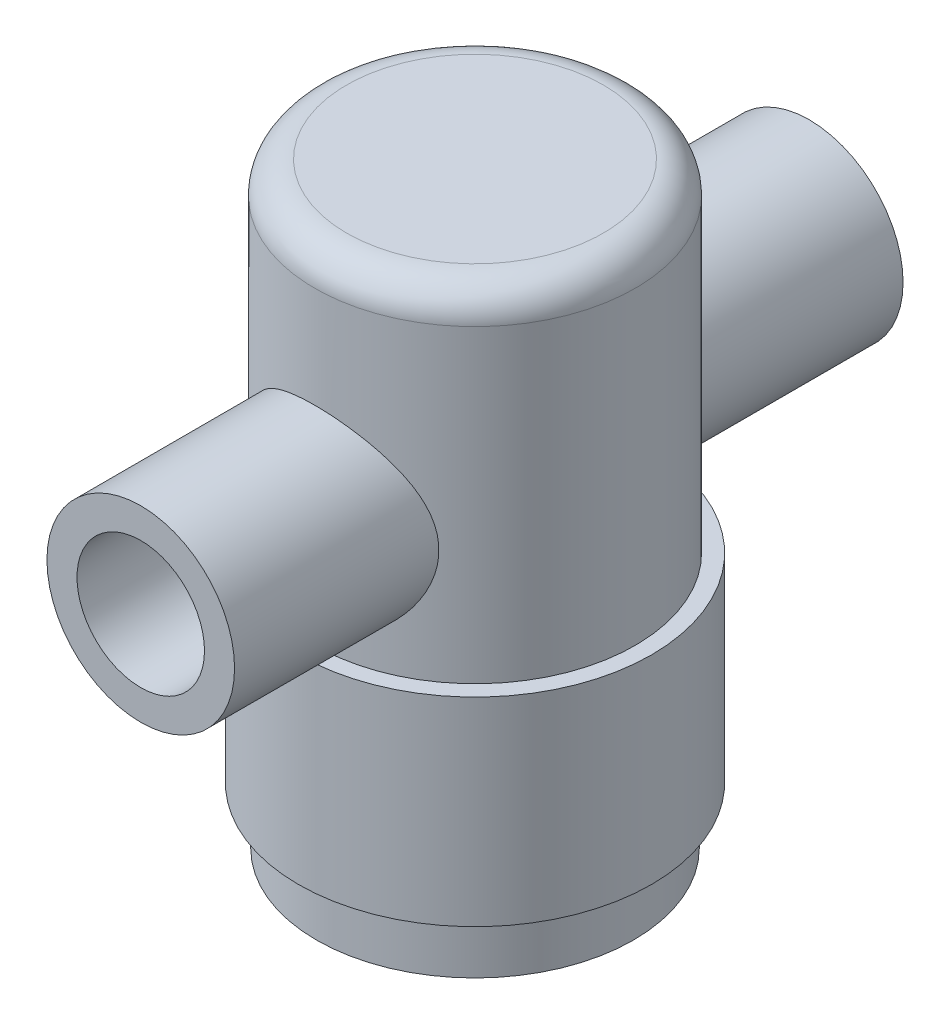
ISO-10303-21;
HEADER;
FILE_DESCRIPTION(('STEP AP214'),'2;1');
FILE_NAME('part.step','',(''),(''),'','','');
FILE_SCHEMA(('AUTOMOTIVE_DESIGN { 1 0 10303 214 1 1 1 1 }'));
ENDSEC;
DATA;
#1=APPLICATION_CONTEXT('core data for automotive mechanical design processes');
#2=APPLICATION_PROTOCOL_DEFINITION('international standard','automotive_design',2000,#1);
#3=PRODUCT_CONTEXT('',#1,'mechanical');
#4=PRODUCT('Part','Part','',(#3));
#5=PRODUCT_RELATED_PRODUCT_CATEGORY('part','',(#4));
#6=PRODUCT_DEFINITION_FORMATION('','',#4);
#7=PRODUCT_DEFINITION_CONTEXT('part definition',#1,'design');
#8=PRODUCT_DEFINITION('design','',#6,#7);
#9=PRODUCT_DEFINITION_SHAPE('','',#8);
#10=(LENGTH_UNIT() NAMED_UNIT(*) SI_UNIT(.MILLI.,.METRE.));
#11=(NAMED_UNIT(*) PLANE_ANGLE_UNIT() SI_UNIT($,.RADIAN.));
#12=(NAMED_UNIT(*) SI_UNIT($,.STERADIAN.) SOLID_ANGLE_UNIT());
#13=UNCERTAINTY_MEASURE_WITH_UNIT(LENGTH_MEASURE(1.E-05),#10,'distance_accuracy_value','');
#14=(GEOMETRIC_REPRESENTATION_CONTEXT(3) GLOBAL_UNCERTAINTY_ASSIGNED_CONTEXT((#13)) GLOBAL_UNIT_ASSIGNED_CONTEXT((#10,
#11,#12)) REPRESENTATION_CONTEXT('',''));
#15=CARTESIAN_POINT('',(0.,0.,0.));
#16=DIRECTION('',(0.,0.,1.));
#17=DIRECTION('',(1.,0.,0.));
#18=AXIS2_PLACEMENT_3D('',#15,#16,#17);
#19=CARTESIAN_POINT('',(0.,18.4404,-16.6497));
#20=DIRECTION('',(0.,0.,1.));
#21=DIRECTION('',(1.,0.,0.));
#22=AXIS2_PLACEMENT_3D('',#19,#20,#21);
#23=CYLINDRICAL_SURFACE('',#22,0.79375);
#24=CARTESIAN_POINT('',(0.79375,18.4404,-3.07418053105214));
#25=CARTESIAN_POINT('',(0.793748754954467,18.4842311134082,-3.07418136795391));
#26=CARTESIAN_POINT('',(0.790107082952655,18.5280760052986,-3.07512817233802));
#27=CARTESIAN_POINT('',(0.775659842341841,18.6145067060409,-3.07880341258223));
#28=CARTESIAN_POINT('',(0.764850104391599,18.6570917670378,-3.08153288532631));
#29=CARTESIAN_POINT('',(0.736438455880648,18.7397401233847,-3.08844545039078));
#30=CARTESIAN_POINT('',(0.718845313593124,18.7798065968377,-3.09262666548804));
#31=CARTESIAN_POINT('',(0.677392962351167,18.8564236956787,-3.10196925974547));
#32=CARTESIAN_POINT('',(0.653533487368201,18.8929741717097,-3.10713068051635));
#33=CARTESIAN_POINT('',(0.599664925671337,18.9623260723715,-3.11797927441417));
#34=CARTESIAN_POINT('',(0.569543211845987,18.9950387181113,-3.12367484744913));
#35=CARTESIAN_POINT('',(0.504247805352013,19.0550042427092,-3.13487712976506));
#36=CARTESIAN_POINT('',(0.469073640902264,19.0822566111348,-3.14038382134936));
#37=CARTESIAN_POINT('',(0.394063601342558,19.130891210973,-3.15068081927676));
#38=CARTESIAN_POINT('',(0.35416952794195,19.1521862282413,-3.15546005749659));
#39=CARTESIAN_POINT('',(0.271228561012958,19.1877345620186,-3.16366782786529));
#40=CARTESIAN_POINT('',(0.228182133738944,19.2019889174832,-3.16709655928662));
#41=CARTESIAN_POINT('',(0.141083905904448,19.2227669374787,-3.1721576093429));
#42=CARTESIAN_POINT('',(0.097070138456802,19.2294413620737,-3.17382491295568));
#43=CARTESIAN_POINT('',(0.00851815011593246,19.23534328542,-3.17529716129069));
#44=CARTESIAN_POINT('',(-0.0360199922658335,19.2345718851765,-3.17510238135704));
#45=CARTESIAN_POINT('',(-0.123310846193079,19.2257124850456,-3.17289845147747));
#46=CARTESIAN_POINT('',(-0.166081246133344,19.2177872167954,-3.17092965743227));
#47=CARTESIAN_POINT('',(-0.249664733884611,19.1951066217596,-3.16544590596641));
#48=CARTESIAN_POINT('',(-0.290477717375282,19.1803509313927,-3.16193086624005));
#49=CARTESIAN_POINT('',(-0.369416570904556,19.1442966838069,-3.15368784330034));
#50=CARTESIAN_POINT('',(-0.407514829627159,19.1229402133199,-3.1489491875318));
#51=CARTESIAN_POINT('',(-0.47964377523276,19.0743345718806,-3.13877294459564));
#52=CARTESIAN_POINT('',(-0.513673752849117,19.047084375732,-3.13333523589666));
#53=CARTESIAN_POINT('',(-0.577670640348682,18.9865924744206,-3.12217979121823));
#54=CARTESIAN_POINT('',(-0.607502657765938,18.9532085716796,-3.11645845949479));
#55=CARTESIAN_POINT('',(-0.661174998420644,18.881852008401,-3.10551526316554));
#56=CARTESIAN_POINT('',(-0.685015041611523,18.8438791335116,-3.10029342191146));
#57=CARTESIAN_POINT('',(-0.726113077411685,18.7641579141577,-3.09092757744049));
#58=CARTESIAN_POINT('',(-0.743338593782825,18.7223921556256,-3.08678892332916));
#59=CARTESIAN_POINT('',(-0.770481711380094,18.6364291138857,-3.08012668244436));
#60=CARTESIAN_POINT('',(-0.780400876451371,18.5922323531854,-3.07760275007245));
#61=CARTESIAN_POINT('',(-0.792425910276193,18.5039128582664,-3.07452825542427));
#62=CARTESIAN_POINT('',(-0.794731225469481,18.4598190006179,-3.07392733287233));
#63=CARTESIAN_POINT('',(-0.792009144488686,18.3718765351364,-3.0746298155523));
#64=CARTESIAN_POINT('',(-0.786982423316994,18.3280279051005,-3.07593304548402));
#65=CARTESIAN_POINT('',(-0.769913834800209,18.2425612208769,-3.08024873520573));
#66=CARTESIAN_POINT('',(-0.757988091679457,18.2009184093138,-3.08323288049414));
#67=CARTESIAN_POINT('',(-0.727588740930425,18.1202230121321,-3.09054728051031));
#68=CARTESIAN_POINT('',(-0.709114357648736,18.0811707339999,-3.09487769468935));
#69=CARTESIAN_POINT('',(-0.66572468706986,18.0059198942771,-3.10450273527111));
#70=CARTESIAN_POINT('',(-0.640690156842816,17.9697923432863,-3.10981461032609));
#71=CARTESIAN_POINT('',(-0.585041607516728,17.9021776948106,-3.1207617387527));
#72=CARTESIAN_POINT('',(-0.554426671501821,17.8706913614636,-3.12639704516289));
#73=CARTESIAN_POINT('',(-0.487571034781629,17.8124449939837,-3.13752675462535));
#74=CARTESIAN_POINT('',(-0.451208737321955,17.7858229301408,-3.14301410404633));
#75=CARTESIAN_POINT('',(-0.374414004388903,17.739062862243,-3.15308366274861));
#76=CARTESIAN_POINT('',(-0.333981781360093,17.7189245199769,-3.15766591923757));
#77=CARTESIAN_POINT('',(-0.250474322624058,17.6858783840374,-3.16538011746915));
#78=CARTESIAN_POINT('',(-0.207420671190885,17.6729185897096,-3.16852246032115));
#79=CARTESIAN_POINT('',(-0.119657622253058,17.6544413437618,-3.17304830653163));
#80=CARTESIAN_POINT('',(-0.0749485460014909,17.6489224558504,-3.17443214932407));
#81=CARTESIAN_POINT('',(0.0135600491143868,17.6455644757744,-3.17527121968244));
#82=CARTESIAN_POINT('',(0.0573514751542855,17.6475217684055,-3.17477758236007));
#83=CARTESIAN_POINT('',(0.143960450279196,17.6585942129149,-3.1720305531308));
#84=CARTESIAN_POINT('',(0.186778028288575,17.6677091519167,-3.16977721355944));
#85=CARTESIAN_POINT('',(0.27001075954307,17.6927289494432,-3.16377187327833));
#86=CARTESIAN_POINT('',(0.310437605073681,17.7085969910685,-3.16002800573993));
#87=CARTESIAN_POINT('',(0.388077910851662,17.7466391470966,-3.15143585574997));
#88=CARTESIAN_POINT('',(0.425290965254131,17.7688140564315,-3.14658743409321));
#89=CARTESIAN_POINT('',(0.496412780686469,17.8194614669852,-3.13616379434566));
#90=CARTESIAN_POINT('',(0.53022102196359,17.8480721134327,-3.13057394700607));
#91=CARTESIAN_POINT('',(0.592625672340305,17.9105106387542,-3.11936327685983));
#92=CARTESIAN_POINT('',(0.621220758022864,17.9443398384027,-3.11374244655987));
#93=CARTESIAN_POINT('',(0.672911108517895,18.0170148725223,-3.10298683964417));
#94=CARTESIAN_POINT('',(0.695893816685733,18.0559425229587,-3.09786308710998));
#95=CARTESIAN_POINT('',(0.73495447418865,18.1372315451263,-3.088830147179));
#96=CARTESIAN_POINT('',(0.751037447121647,18.1795903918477,-3.08492007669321));
#97=CARTESIAN_POINT('',(0.773447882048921,18.2582955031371,-3.07936827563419));
#98=CARTESIAN_POINT('',(0.781044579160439,18.2942651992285,-3.07743751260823));
#99=CARTESIAN_POINT('',(0.791195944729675,18.3669534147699,-3.07484334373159));
#100=CARTESIAN_POINT('',(0.793751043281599,18.4036718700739,-3.0741798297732));
#101=CARTESIAN_POINT('',(0.79375,18.4404,-3.07418053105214));
#102=B_SPLINE_CURVE_WITH_KNOTS('',3,(#24,#25,#26,#27,#28,#29,#30,#31,#32,#33,#34,#35,#36,#37,
#38,#39,#40,#41,#42,#43,#44,#45,#46,#47,#48,#49,#50,#51,#52,#53,#54,#55,#56,#57,#58,#59,#60,#61,
#62,#63,#64,#65,#66,#67,#68,#69,#70,#71,#72,#73,#74,#75,#76,#77,#78,#79,#80,#81,#82,#83,#84,#85,
#86,#87,#88,#89,#90,#91,#92,#93,#94,#95,#96,#97,#98,#99,#100,#101),.UNSPECIFIED.,.T.,.F.,(4,2,2,
2,2,2,2,2,2,2,2,2,2,2,2,2,2,2,2,2,2,2,2,2,2,2,2,2,2,2,2,2,2,2,2,2,2,2,4),(0.,0.131358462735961,
0.262793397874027,0.394059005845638,0.525330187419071,0.659206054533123,0.793094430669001,
0.928851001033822,1.06458753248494,1.19757428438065,1.33054137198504,1.46055798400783,
1.59058151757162,1.72177987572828,1.85300107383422,1.98777373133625,2.12255268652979,
2.2579851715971,2.39338866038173,2.52521584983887,2.65703090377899,2.78668926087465,
2.91636298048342,3.04858053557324,3.18081983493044,3.31636792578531,3.45190894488,
3.58645483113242,3.72097474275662,3.8518574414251,3.98273624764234,4.11291048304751,
4.2431011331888,4.3764107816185,4.50975422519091,4.64558531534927,4.78131734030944,
4.89139810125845,5.0014694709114),.UNSPECIFIED.);
#103=CARTESIAN_POINT('',(0.79375,18.4404,-3.07418053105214));
#104=VERTEX_POINT('',#103);
#105=EDGE_CURVE('E115',#104,#104,#102,.T.);
#106=ORIENTED_EDGE('',*,*,#105,.T.);
#107=EDGE_LOOP('',(#106));
#108=FACE_BOUND('',#107,.T.);
#109=CARTESIAN_POINT('',(0.,18.4404,-8.5217));
#110=DIRECTION('',(0.,0.,-1.));
#111=DIRECTION('',(-1.,0.,0.));
#112=AXIS2_PLACEMENT_3D('',#109,#110,#111);
#113=CIRCLE('',#112,0.79375);
#114=CARTESIAN_POINT('',(-0.79375,18.4404,-8.5217));
#115=VERTEX_POINT('',#114);
#116=EDGE_CURVE('E36',#115,#115,#113,.F.);
#117=ORIENTED_EDGE('',*,*,#116,.F.);
#118=EDGE_LOOP('',(#117));
#119=FACE_BOUND('',#118,.T.);
#120=ADVANCED_FACE('F32',(#108,#119),#23,.F.);
#121=CARTESIAN_POINT('',(0.79375,18.4404,3.07418053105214));
#122=CARTESIAN_POINT('',(0.793748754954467,18.3965688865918,3.07418136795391));
#123=CARTESIAN_POINT('',(0.790107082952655,18.3527239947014,3.07512817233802));
#124=CARTESIAN_POINT('',(0.775659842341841,18.2662932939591,3.07880341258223));
#125=CARTESIAN_POINT('',(0.764850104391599,18.2237082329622,3.08153288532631));
#126=CARTESIAN_POINT('',(0.736438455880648,18.1410598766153,3.08844545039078));
#127=CARTESIAN_POINT('',(0.718845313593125,18.1009934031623,3.09262666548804));
#128=CARTESIAN_POINT('',(0.677392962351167,18.0243763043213,3.10196925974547));
#129=CARTESIAN_POINT('',(0.653533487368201,17.9878258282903,3.10713068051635));
#130=CARTESIAN_POINT('',(0.599664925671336,17.9184739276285,3.11797927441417));
#131=CARTESIAN_POINT('',(0.569543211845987,17.8857612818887,3.12367484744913));
#132=CARTESIAN_POINT('',(0.504247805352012,17.8257957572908,3.13487712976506));
#133=CARTESIAN_POINT('',(0.469073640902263,17.7985433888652,3.14038382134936));
#134=CARTESIAN_POINT('',(0.394063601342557,17.749908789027,3.15068081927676));
#135=CARTESIAN_POINT('',(0.35416952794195,17.7286137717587,3.15546005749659));
#136=CARTESIAN_POINT('',(0.271228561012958,17.6930654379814,3.16366782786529));
#137=CARTESIAN_POINT('',(0.228182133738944,17.6788110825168,3.16709655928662));
#138=CARTESIAN_POINT('',(0.141083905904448,17.6580330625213,3.1721576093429));
#139=CARTESIAN_POINT('',(0.0970701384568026,17.6513586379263,3.17382491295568));
#140=CARTESIAN_POINT('',(0.00851815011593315,17.64545671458,3.17529716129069));
#141=CARTESIAN_POINT('',(-0.036019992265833,17.6462281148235,3.17510238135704));
#142=CARTESIAN_POINT('',(-0.123310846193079,17.6550875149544,3.17289845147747));
#143=CARTESIAN_POINT('',(-0.166081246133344,17.6630127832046,3.17092965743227));
#144=CARTESIAN_POINT('',(-0.249664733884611,17.6856933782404,3.16544590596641));
#145=CARTESIAN_POINT('',(-0.290477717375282,17.7004490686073,3.16193086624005));
#146=CARTESIAN_POINT('',(-0.369416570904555,17.7365033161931,3.15368784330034));
#147=CARTESIAN_POINT('',(-0.407514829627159,17.7578597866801,3.1489491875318));
#148=CARTESIAN_POINT('',(-0.47964377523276,17.8064654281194,3.13877294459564));
#149=CARTESIAN_POINT('',(-0.513673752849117,17.833715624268,3.13333523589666));
#150=CARTESIAN_POINT('',(-0.577670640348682,17.8942075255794,3.12217979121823));
#151=CARTESIAN_POINT('',(-0.607502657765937,17.9275914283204,3.11645845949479));
#152=CARTESIAN_POINT('',(-0.661174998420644,17.998947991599,3.10551526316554));
#153=CARTESIAN_POINT('',(-0.685015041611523,18.0369208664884,3.10029342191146));
#154=CARTESIAN_POINT('',(-0.726113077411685,18.1166420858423,3.09092757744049));
#155=CARTESIAN_POINT('',(-0.743338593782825,18.1584078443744,3.08678892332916));
#156=CARTESIAN_POINT('',(-0.770481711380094,18.2443708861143,3.08012668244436));
#157=CARTESIAN_POINT('',(-0.780400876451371,18.2885676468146,3.07760275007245));
#158=CARTESIAN_POINT('',(-0.792425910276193,18.3768871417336,3.07452825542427));
#159=CARTESIAN_POINT('',(-0.794731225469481,18.4209809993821,3.07392733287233));
#160=CARTESIAN_POINT('',(-0.792009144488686,18.5089234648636,3.0746298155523));
#161=CARTESIAN_POINT('',(-0.786982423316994,18.5527720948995,3.07593304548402));
#162=CARTESIAN_POINT('',(-0.769913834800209,18.6382387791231,3.08024873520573));
#163=CARTESIAN_POINT('',(-0.757988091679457,18.6798815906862,3.08323288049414));
#164=CARTESIAN_POINT('',(-0.727588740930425,18.7605769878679,3.09054728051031));
#165=CARTESIAN_POINT('',(-0.709114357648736,18.7996292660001,3.09487769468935));
#166=CARTESIAN_POINT('',(-0.66572468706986,18.8748801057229,3.10450273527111));
#167=CARTESIAN_POINT('',(-0.640690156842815,18.9110076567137,3.10981461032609));
#168=CARTESIAN_POINT('',(-0.585041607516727,18.9786223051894,3.1207617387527));
#169=CARTESIAN_POINT('',(-0.55442667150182,19.0101086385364,3.12639704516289));
#170=CARTESIAN_POINT('',(-0.487571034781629,19.0683550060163,3.13752675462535));
#171=CARTESIAN_POINT('',(-0.451208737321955,19.0949770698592,3.14301410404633));
#172=CARTESIAN_POINT('',(-0.374414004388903,19.141737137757,3.15308366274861));
#173=CARTESIAN_POINT('',(-0.333981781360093,19.1618754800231,3.15766591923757));
#174=CARTESIAN_POINT('',(-0.250474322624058,19.1949216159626,3.16538011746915));
#175=CARTESIAN_POINT('',(-0.207420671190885,19.2078814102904,3.16852246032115));
#176=CARTESIAN_POINT('',(-0.119657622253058,19.2263586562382,3.17304830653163));
#177=CARTESIAN_POINT('',(-0.0749485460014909,19.2318775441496,3.17443214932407));
#178=CARTESIAN_POINT('',(0.0135600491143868,19.2352355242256,3.17527121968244));
#179=CARTESIAN_POINT('',(0.0573514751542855,19.2332782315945,3.17477758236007));
#180=CARTESIAN_POINT('',(0.143960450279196,19.2222057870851,3.1720305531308));
#181=CARTESIAN_POINT('',(0.186778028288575,19.2130908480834,3.16977721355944));
#182=CARTESIAN_POINT('',(0.27001075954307,19.1880710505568,3.16377187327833));
#183=CARTESIAN_POINT('',(0.310437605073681,19.1722030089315,3.16002800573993));
#184=CARTESIAN_POINT('',(0.388077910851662,19.1341608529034,3.15143585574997));
#185=CARTESIAN_POINT('',(0.425290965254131,19.1119859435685,3.14658743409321));
#186=CARTESIAN_POINT('',(0.496412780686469,19.0613385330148,3.13616379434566));
#187=CARTESIAN_POINT('',(0.53022102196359,19.0327278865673,3.13057394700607));
#188=CARTESIAN_POINT('',(0.592625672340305,18.9702893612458,3.11936327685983));
#189=CARTESIAN_POINT('',(0.621220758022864,18.9364601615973,3.11374244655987));
#190=CARTESIAN_POINT('',(0.672911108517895,18.8637851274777,3.10298683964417));
#191=CARTESIAN_POINT('',(0.695893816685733,18.8248574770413,3.09786308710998));
#192=CARTESIAN_POINT('',(0.73495447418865,18.7435684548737,3.088830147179));
#193=CARTESIAN_POINT('',(0.751037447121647,18.7012096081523,3.08492007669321));
#194=CARTESIAN_POINT('',(0.773447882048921,18.6225044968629,3.07936827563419));
#195=CARTESIAN_POINT('',(0.781044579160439,18.5865348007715,3.07743751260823));
#196=CARTESIAN_POINT('',(0.791195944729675,18.5138465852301,3.07484334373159));
#197=CARTESIAN_POINT('',(0.793751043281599,18.4771281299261,3.0741798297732));
#198=CARTESIAN_POINT('',(0.79375,18.4404,3.07418053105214));
#199=B_SPLINE_CURVE_WITH_KNOTS('',3,(#121,#122,#123,#124,#125,#126,#127,#128,#129,#130,#131,
#132,#133,#134,#135,#136,#137,#138,#139,#140,#141,#142,#143,#144,#145,#146,#147,#148,#149,#150,
#151,#152,#153,#154,#155,#156,#157,#158,#159,#160,#161,#162,#163,#164,#165,#166,#167,#168,#169,
#170,#171,#172,#173,#174,#175,#176,#177,#178,#179,#180,#181,#182,#183,#184,#185,#186,#187,#188,
#189,#190,#191,#192,#193,#194,#195,#196,#197,#198),.UNSPECIFIED.,.T.,.F.,(4,2,2,2,2,2,2,2,2,2,2,
2,2,2,2,2,2,2,2,2,2,2,2,2,2,2,2,2,2,2,2,2,2,2,2,2,2,2,4),(0.,0.131358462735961,
0.262793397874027,0.394059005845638,0.525330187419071,0.659206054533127,0.793094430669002,
0.928851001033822,1.06458753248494,1.19757428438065,1.33054137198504,1.46055798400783,
1.59058151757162,1.72177987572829,1.85300107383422,1.98777373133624,2.1225526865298,
2.2579851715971,2.39338866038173,2.52521584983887,2.65703090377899,2.78668926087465,
2.91636298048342,3.04858053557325,3.18081983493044,3.31636792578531,3.45190894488,
3.58645483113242,3.72097474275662,3.8518574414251,3.98273624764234,4.11291048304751,
4.2431011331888,4.3764107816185,4.50975422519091,4.64558531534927,4.78131734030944,
4.89139810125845,5.0014694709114),.UNSPECIFIED.);
#200=CARTESIAN_POINT('',(0.79375,18.4404,3.07418053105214));
#201=VERTEX_POINT('',#200);
#202=EDGE_CURVE('E110',#201,#201,#199,.T.);
#203=ORIENTED_EDGE('',*,*,#202,.T.);
#204=EDGE_LOOP('',(#203));
#205=FACE_BOUND('',#204,.T.);
#206=CARTESIAN_POINT('',(0.,18.4404,8.5217));
#207=DIRECTION('',(0.,0.,1.));
#208=DIRECTION('',(1.,0.,0.));
#209=AXIS2_PLACEMENT_3D('',#206,#207,#208);
#210=CIRCLE('',#209,0.79375);
#211=CARTESIAN_POINT('',(0.79375,18.4404,8.5217));
#212=VERTEX_POINT('',#211);
#213=EDGE_CURVE('E54',#212,#212,#210,.F.);
#214=ORIENTED_EDGE('',*,*,#213,.F.);
#215=EDGE_LOOP('',(#214));
#216=FACE_BOUND('',#215,.T.);
#217=ADVANCED_FACE('F93',(#205,#216),#23,.F.);
#218=CARTESIAN_POINT('',(0.,0.,0.));
#219=DIRECTION('',(0.,-1.,0.));
#220=DIRECTION('',(0.,0.,-1.));
#221=AXIS2_PLACEMENT_3D('',#218,#219,#220);
#222=CYLINDRICAL_SURFACE('',#221,3.175);
#223=CARTESIAN_POINT('',(0.,2.38760000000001,0.));
#224=DIRECTION('',(0.,-1.,0.));
#225=DIRECTION('',(0.,0.,-1.));
#226=AXIS2_PLACEMENT_3D('',#223,#224,#225);
#227=CIRCLE('',#226,3.175);
#228=CARTESIAN_POINT('',(0.,2.38760000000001,-3.175));
#229=VERTEX_POINT('',#228);
#230=EDGE_CURVE('E143',#229,#229,#227,.T.);
#231=ORIENTED_EDGE('',*,*,#230,.T.);
#232=EDGE_LOOP('',(#231));
#233=FACE_BOUND('',#232,.T.);
#234=CARTESIAN_POINT('',(0.,27.6479,0.));
#235=DIRECTION('',(0.,-1.,0.));
#236=DIRECTION('',(0.,0.,-1.));
#237=AXIS2_PLACEMENT_3D('',#234,#235,#236);
#238=CIRCLE('',#237,3.175);
#239=CARTESIAN_POINT('',(0.,27.6479,-3.175));
#240=VERTEX_POINT('',#239);
#241=EDGE_CURVE('E140',#240,#240,#238,.T.);
#242=ORIENTED_EDGE('',*,*,#241,.F.);
#243=EDGE_LOOP('',(#242));
#244=FACE_BOUND('',#243,.T.);
#245=ORIENTED_EDGE('',*,*,#105,.F.);
#246=EDGE_LOOP('',(#245));
#247=FACE_BOUND('',#246,.T.);
#248=ORIENTED_EDGE('',*,*,#202,.F.);
#249=EDGE_LOOP('',(#248));
#250=FACE_BOUND('',#249,.T.);
#251=ADVANCED_FACE('F99',(#233,#244,#247,#250),#222,.F.);
#252=CARTESIAN_POINT('',(0.,0.,0.));
#253=DIRECTION('',(0.,-1.,0.));
#254=DIRECTION('',(0.,0.,-1.));
#255=AXIS2_PLACEMENT_3D('',#252,#253,#254);
#256=CYLINDRICAL_SURFACE('',#255,7.98195);
#257=CARTESIAN_POINT('',(-4.6736,18.4404,6.47062507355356));
#258=CARTESIAN_POINT('',(-4.67360004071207,18.3221364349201,6.47062498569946));
#259=CARTESIAN_POINT('',(-4.66910419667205,18.2038738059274,6.47387943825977));
#260=CARTESIAN_POINT('',(-4.65120218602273,17.9683806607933,6.48675295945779));
#261=CARTESIAN_POINT('',(-4.63779599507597,17.8511501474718,6.49637204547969));
#262=CARTESIAN_POINT('',(-4.60228279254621,17.6185893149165,6.52157891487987));
#263=CARTESIAN_POINT('',(-4.58016998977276,17.5032603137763,6.53717067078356));
#264=CARTESIAN_POINT('',(-4.52757619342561,17.275372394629,6.5737050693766));
#265=CARTESIAN_POINT('',(-4.49709128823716,17.1628147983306,6.59465021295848));
#266=CARTESIAN_POINT('',(-4.39414663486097,16.8319807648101,6.66407139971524));
#267=CARTESIAN_POINT('',(-4.30990350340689,16.61867871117,6.71935555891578));
#268=CARTESIAN_POINT('',(-4.1130541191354,16.2094761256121,6.84161373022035));
#269=CARTESIAN_POINT('',(-4.00043882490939,16.0135811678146,6.90859146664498));
#270=CARTESIAN_POINT('',(-3.73482652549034,15.6196963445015,7.05607999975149));
#271=CARTESIAN_POINT('',(-3.57866321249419,15.4240914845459,7.13725974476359));
#272=CARTESIAN_POINT('',(-3.23675681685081,15.0598188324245,7.29867295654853));
#273=CARTESIAN_POINT('',(-3.05099321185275,14.8911698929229,7.3789057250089));
#274=CARTESIAN_POINT('',(-2.74234453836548,14.6534138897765,7.49699393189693));
#275=CARTESIAN_POINT('',(-2.62865045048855,14.5735989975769,7.53770940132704));
#276=CARTESIAN_POINT('',(-2.39374084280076,14.4239444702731,7.61556380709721));
#277=CARTESIAN_POINT('',(-2.27252845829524,14.3541007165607,7.6527042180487));
#278=CARTESIAN_POINT('',(-2.02331400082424,14.2251400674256,7.72233531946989));
#279=CARTESIAN_POINT('',(-1.89531476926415,14.1660187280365,7.75482793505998));
#280=CARTESIAN_POINT('',(-1.63336897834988,14.0592316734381,7.81419561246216));
#281=CARTESIAN_POINT('',(-1.49942334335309,14.0115641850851,7.84107154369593));
#282=CARTESIAN_POINT('',(-1.23921777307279,13.9322249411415,7.88616942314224));
#283=CARTESIAN_POINT('',(-1.11338114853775,13.8994864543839,7.90495933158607));
#284=CARTESIAN_POINT('',(-0.858712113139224,13.844520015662,7.93666152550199));
#285=CARTESIAN_POINT('',(-0.729880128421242,13.8222905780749,7.94957464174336));
#286=CARTESIAN_POINT('',(-0.470425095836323,13.7886973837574,7.96913669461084));
#287=CARTESIAN_POINT('',(-0.339803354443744,13.7773260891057,7.97578997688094));
#288=CARTESIAN_POINT('',(-0.0779020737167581,13.7656117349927,7.9826443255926));
#289=CARTESIAN_POINT('',(0.0533774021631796,13.7652676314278,7.98284600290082));
#290=CARTESIAN_POINT('',(0.299796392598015,13.7749940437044,7.97715432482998));
#291=CARTESIAN_POINT('',(0.415003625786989,13.7838342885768,7.97198096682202));
#292=CARTESIAN_POINT('',(0.644163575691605,13.8099687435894,7.95674365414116));
#293=CARTESIAN_POINT('',(0.75811589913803,13.8272655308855,7.94667820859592));
#294=CARTESIAN_POINT('',(0.983905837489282,13.8700978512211,7.9218902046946));
#295=CARTESIAN_POINT('',(1.09574415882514,13.8956305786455,7.90716923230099));
#296=CARTESIAN_POINT('',(1.31665281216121,13.9546385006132,7.87340249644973));
#297=CARTESIAN_POINT('',(1.42572205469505,13.9881167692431,7.85435505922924));
#298=CARTESIAN_POINT('',(1.74930030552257,14.1004965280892,7.7910107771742));
#299=CARTESIAN_POINT('',(1.95871795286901,14.1910615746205,7.74067967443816));
#300=CARTESIAN_POINT('',(2.35957148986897,14.3998334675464,7.62807042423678));
#301=CARTESIAN_POINT('',(2.55100236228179,14.5180479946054,7.56578895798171));
#302=CARTESIAN_POINT('',(2.93445646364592,14.7943602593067,7.42608661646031));
#303=CARTESIAN_POINT('',(3.12395989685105,14.9554973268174,7.34774743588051));
#304=CARTESIAN_POINT('',(3.47479739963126,15.3051402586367,7.18850055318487));
#305=CARTESIAN_POINT('',(3.63609469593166,15.4936812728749,7.10758965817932));
#306=CARTESIAN_POINT('',(3.94351527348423,15.9171696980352,6.9421762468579));
#307=CARTESIAN_POINT('',(4.08614051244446,16.1549273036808,6.8582234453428));
#308=CARTESIAN_POINT('',(4.26786082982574,16.5306198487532,6.74551760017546));
#309=CARTESIAN_POINT('',(4.32305566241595,16.6589949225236,6.71015950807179));
#310=CARTESIAN_POINT('',(4.42210257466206,16.9214482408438,6.6453004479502));
#311=CARTESIAN_POINT('',(4.46595886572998,17.0555243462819,6.61579730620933));
#312=CARTESIAN_POINT('',(4.56137614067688,17.3998326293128,6.55059793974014));
#313=CARTESIAN_POINT('',(4.60500912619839,17.6132851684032,6.51970787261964));
#314=CARTESIAN_POINT('',(4.66203059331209,18.0459900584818,6.47906429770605));
#315=CARTESIAN_POINT('',(4.67545099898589,18.2652360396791,6.4692884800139));
#316=CARTESIAN_POINT('',(4.67133536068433,18.7034992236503,6.47226042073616));
#317=CARTESIAN_POINT('',(4.6537697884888,18.9225160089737,6.4850296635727));
#318=CARTESIAN_POINT('',(4.58866351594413,19.3538392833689,6.531249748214));
#319=CARTESIAN_POINT('',(4.54110001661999,19.5661405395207,6.56471631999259));
#320=CARTESIAN_POINT('',(4.41793404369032,19.9803411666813,6.64822473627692));
#321=CARTESIAN_POINT('',(4.34215958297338,20.1821678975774,6.69836804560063));
#322=CARTESIAN_POINT('',(4.16519394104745,20.5709807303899,6.80981611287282));
#323=CARTESIAN_POINT('',(4.06399277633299,20.7579609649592,6.87112525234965));
#324=CARTESIAN_POINT('',(3.81880485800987,21.1460850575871,7.01080926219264));
#325=CARTESIAN_POINT('',(3.67044176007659,21.3440615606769,7.09029980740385));
#326=CARTESIAN_POINT('',(3.34435183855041,21.7143446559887,7.2498108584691));
#327=CARTESIAN_POINT('',(3.16659873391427,21.8866280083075,7.32983177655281));
#328=CARTESIAN_POINT('',(2.86916511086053,22.1322166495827,7.4493381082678));
#329=CARTESIAN_POINT('',(2.75856981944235,22.2155978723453,7.49109884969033));
#330=CARTESIAN_POINT('',(2.52963889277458,22.3726658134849,7.57146905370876));
#331=CARTESIAN_POINT('',(2.41130627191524,22.4463562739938,7.6100797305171));
#332=CARTESIAN_POINT('',(2.16756019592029,22.5833166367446,7.68305876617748));
#333=CARTESIAN_POINT('',(2.04214897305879,22.6465897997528,7.71742845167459));
#334=CARTESIAN_POINT('',(1.78502078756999,22.7619836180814,7.78092226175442));
#335=CARTESIAN_POINT('',(1.65330470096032,22.8141058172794,7.81004711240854));
#336=CARTESIAN_POINT('',(1.39503354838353,22.9028643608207,7.860110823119));
#337=CARTESIAN_POINT('',(1.2688731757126,22.9403895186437,7.8815100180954));
#338=CARTESIAN_POINT('',(1.01303226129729,23.0047943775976,7.91845867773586));
#339=CARTESIAN_POINT('',(0.883352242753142,23.0316756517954,7.93400900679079));
#340=CARTESIAN_POINT('',(0.621686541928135,23.0743618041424,7.95878689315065));
#341=CARTESIAN_POINT('',(0.489702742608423,23.0901753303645,7.96801938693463));
#342=CARTESIAN_POINT('',(0.224577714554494,23.1104932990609,7.97989291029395));
#343=CARTESIAN_POINT('',(0.0914366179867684,23.1149990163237,7.98253468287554));
#344=CARTESIAN_POINT('',(-0.158040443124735,23.1127784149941,7.98123496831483));
#345=CARTESIAN_POINT('',(-0.274395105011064,23.107386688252,7.97807569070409));
#346=CARTESIAN_POINT('',(-0.506170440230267,23.0879645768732,7.96672975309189));
#347=CARTESIAN_POINT('',(-0.621590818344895,23.0739315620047,7.9585415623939));
#348=CARTESIAN_POINT('',(-0.850590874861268,23.0374062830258,7.93733162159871));
#349=CARTESIAN_POINT('',(-0.964171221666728,23.01491716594,7.9243116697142));
#350=CARTESIAN_POINT('',(-1.18879335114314,22.9617550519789,7.89374278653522));
#351=CARTESIAN_POINT('',(-1.29983413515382,22.9310788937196,7.87619210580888));
#352=CARTESIAN_POINT('',(-1.62655346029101,22.8277327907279,7.81757099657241));
#353=CARTESIAN_POINT('',(-1.8375948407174,22.743457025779,7.77035889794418));
#354=CARTESIAN_POINT('',(-2.24258401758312,22.5469974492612,7.66331350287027));
#355=CARTESIAN_POINT('',(-2.4365275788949,22.4348067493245,7.60347709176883));
#356=CARTESIAN_POINT('',(-2.8248419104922,22.171841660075,7.46850167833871));
#357=CARTESIAN_POINT('',(-3.01692419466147,22.0181842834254,7.392403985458));
#358=CARTESIAN_POINT('',(-3.37417479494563,21.6834662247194,7.23633338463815));
#359=CARTESIAN_POINT('',(-3.539311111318,21.502373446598,7.1563560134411));
#360=CARTESIAN_POINT('',(-3.77338055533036,21.2013433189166,7.03435170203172));
#361=CARTESIAN_POINT('',(-3.85259263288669,21.0897168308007,6.99116297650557));
#362=CARTESIAN_POINT('',(-4.00131123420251,20.8592526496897,6.9071209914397));
#363=CARTESIAN_POINT('',(-4.07081531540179,20.7404131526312,6.86626832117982));
#364=CARTESIAN_POINT('',(-4.19944988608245,20.4961716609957,6.78835788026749));
#365=CARTESIAN_POINT('',(-4.25858781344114,20.3707744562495,6.75129739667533));
#366=CARTESIAN_POINT('',(-4.36586332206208,20.1140497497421,6.68242680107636));
#367=CARTESIAN_POINT('',(-4.41400886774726,19.9827266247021,6.65061289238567));
#368=CARTESIAN_POINT('',(-4.49182500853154,19.7365201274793,6.5982471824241));
#369=CARTESIAN_POINT('',(-4.5232217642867,19.622391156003,6.57670694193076));
#370=CARTESIAN_POINT('',(-4.57738570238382,19.3912687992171,6.53912497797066));
#371=CARTESIAN_POINT('',(-4.60015788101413,19.2742771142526,6.52308007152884));
#372=CARTESIAN_POINT('',(-4.6367270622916,19.0383414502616,6.4971372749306));
#373=CARTESIAN_POINT('',(-4.65053320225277,18.9193995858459,6.48723312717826));
#374=CARTESIAN_POINT('',(-4.66896960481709,18.6804381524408,6.4739771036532));
#375=CARTESIAN_POINT('',(-4.67359995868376,18.5604185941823,6.4706251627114));
#376=CARTESIAN_POINT('',(-4.6736,18.4404,6.47062507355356));
#377=B_SPLINE_CURVE_WITH_KNOTS('',3,(#257,#258,#259,#260,#261,#262,#263,#264,#265,#266,#267,
#268,#269,#270,#271,#272,#273,#274,#275,#276,#277,#278,#279,#280,#281,#282,#283,#284,#285,#286,
#287,#288,#289,#290,#291,#292,#293,#294,#295,#296,#297,#298,#299,#300,#301,#302,#303,#304,#305,
#306,#307,#308,#309,#310,#311,#312,#313,#314,#315,#316,#317,#318,#319,#320,#321,#322,#323,#324,
#325,#326,#327,#328,#329,#330,#331,#332,#333,#334,#335,#336,#337,#338,#339,#340,#341,#342,#343,
#344,#345,#346,#347,#348,#349,#350,#351,#352,#353,#354,#355,#356,#357,#358,#359,#360,#361,#362,
#363,#364,#365,#366,#367,#368,#369,#370,#371,#372,#373,#374,#375,#376),.UNSPECIFIED.,.T.,.F.,(4,
2,2,2,2,2,2,2,2,2,2,2,2,2,2,2,2,2,2,2,2,2,2,2,2,2,2,2,2,2,2,2,2,2,2,2,2,2,2,2,2,2,2,2,2,2,2,2,2,
2,2,2,2,2,2,2,2,2,2,4),(0.,0.354660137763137,0.70932124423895,1.06421865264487,1.41928215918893,
2.12378075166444,2.82850413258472,3.6148461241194,4.40173569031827,4.8355139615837,
5.26911253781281,5.70253099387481,6.13588231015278,6.52945028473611,6.92296260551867,
7.31620154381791,7.70940324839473,8.05597361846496,8.40264967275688,8.74920775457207,
9.09590013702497,9.79372697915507,10.4917478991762,11.2709399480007,12.0511404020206,
12.9152569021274,13.3471160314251,13.7788145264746,14.4358563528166,15.0922035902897,
15.7491766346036,16.4066495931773,17.0681982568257,17.7300070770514,18.5065903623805,
19.2838718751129,19.7173851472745,20.1507305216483,20.5839399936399,21.0170894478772,
21.4165691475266,21.815989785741,22.2150979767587,22.614161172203,22.9633024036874,
23.3125499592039,23.6616676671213,24.010920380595,24.7040976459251,25.3974461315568,
26.1668782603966,26.9372175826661,27.3673587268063,27.7976079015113,28.2275470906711,
28.6571737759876,29.0176775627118,29.37797218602,29.7378990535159,30.0978223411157),.UNSPECIFIED.);
#378=CARTESIAN_POINT('',(-4.6736,18.4404,6.47062507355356));
#379=VERTEX_POINT('',#378);
#380=EDGE_CURVE('E40',#379,#379,#377,.T.);
#381=ORIENTED_EDGE('',*,*,#380,.F.);
#382=EDGE_LOOP('',(#381));
#383=FACE_BOUND('',#382,.T.);
#384=CARTESIAN_POINT('',(0.,28.1559,0.));
#385=DIRECTION('',(0.,-1.,0.));
#386=DIRECTION('',(0.,0.,-1.));
#387=AXIS2_PLACEMENT_3D('',#384,#385,#386);
#388=CIRCLE('',#387,7.98195);
#389=CARTESIAN_POINT('',(0.,28.1559,-7.98195));
#390=VERTEX_POINT('',#389);
#391=EDGE_CURVE('E149',#390,#390,#388,.T.);
#392=ORIENTED_EDGE('',*,*,#391,.T.);
#393=EDGE_LOOP('',(#392));
#394=FACE_BOUND('',#393,.T.);
#395=CARTESIAN_POINT('',(0.,12.7508,0.));
#396=DIRECTION('',(0.,-1.,0.));
#397=DIRECTION('',(0.,0.,-1.));
#398=AXIS2_PLACEMENT_3D('',#395,#396,#397);
#399=CIRCLE('',#398,7.98195);
#400=CARTESIAN_POINT('',(0.,12.7508,-7.98195));
#401=VERTEX_POINT('',#400);
#402=EDGE_CURVE('E137',#401,#401,#399,.T.);
#403=ORIENTED_EDGE('',*,*,#402,.F.);
#404=EDGE_LOOP('',(#403));
#405=FACE_BOUND('',#404,.T.);
#406=CARTESIAN_POINT('',(0.,23.114,-7.98195));
#407=CARTESIAN_POINT('',(0.120058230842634,23.1139991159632,-7.98194919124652));
#408=CARTESIAN_POINT('',(0.240160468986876,23.1093661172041,-7.97923403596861));
#409=CARTESIAN_POINT('',(0.479466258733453,23.0908912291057,-7.96843791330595));
#410=CARTESIAN_POINT('',(0.598669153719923,23.0770431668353,-7.96035334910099));
#411=CARTESIAN_POINT('',(0.835463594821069,23.0402827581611,-7.93899778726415));
#412=CARTESIAN_POINT('',(0.953051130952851,23.0173510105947,-7.92571568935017));
#413=CARTESIAN_POINT('',(1.18554863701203,22.9627093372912,-7.8942872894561));
#414=CARTESIAN_POINT('',(1.30045743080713,22.9309956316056,-7.87613889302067));
#415=CARTESIAN_POINT('',(1.52619456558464,22.8593602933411,-7.83551735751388));
#416=CARTESIAN_POINT('',(1.63704163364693,22.8194840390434,-7.81306817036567));
#417=CARTESIAN_POINT('',(1.8547005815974,22.7318340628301,-7.76428203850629));
#418=CARTESIAN_POINT('',(1.96151090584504,22.6840573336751,-7.73794361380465));
#419=CARTESIAN_POINT('',(2.27488821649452,22.5296009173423,-7.65395591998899));
#420=CARTESIAN_POINT('',(2.47470490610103,22.4116974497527,-7.59127735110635));
#421=CARTESIAN_POINT('',(2.86686163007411,22.1397037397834,-7.45245907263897));
#422=CARTESIAN_POINT('',(3.05753965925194,21.9835739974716,-7.37566483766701));
#423=CARTESIAN_POINT('',(3.41165149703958,21.6440559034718,-7.21870630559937));
#424=CARTESIAN_POINT('',(3.57505086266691,21.4606336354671,-7.13853790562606));
#425=CARTESIAN_POINT('',(3.88901802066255,21.0467671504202,-6.97295197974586));
#426=CARTESIAN_POINT('',(4.03592680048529,20.8133390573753,-6.88799690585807));
#427=CARTESIAN_POINT('',(4.28783383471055,20.3201257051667,-6.73408486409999));
#428=CARTESIAN_POINT('',(4.39289807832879,20.0603827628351,-6.66510277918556));
#429=CARTESIAN_POINT('',(4.53687962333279,19.5832875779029,-6.56764719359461));
#430=CARTESIAN_POINT('',(4.58547409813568,19.3700189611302,-6.53349541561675));
#431=CARTESIAN_POINT('',(4.65233909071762,18.9365985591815,-6.48606335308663));
#432=CARTESIAN_POINT('',(4.6706445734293,18.7164550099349,-6.47275900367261));
#433=CARTESIAN_POINT('',(4.67589766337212,18.2752332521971,-6.46896620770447));
#434=CARTESIAN_POINT('',(4.66279382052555,18.0541541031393,-6.47851519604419));
#435=CARTESIAN_POINT('',(4.60592730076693,17.6179454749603,-6.51905811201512));
#436=CARTESIAN_POINT('',(4.56214254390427,17.4028203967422,-6.55006748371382));
#437=CARTESIAN_POINT('',(4.44663190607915,16.9855645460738,-6.62901016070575));
#438=CARTESIAN_POINT('',(4.37513361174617,16.7833431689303,-6.67680532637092));
#439=CARTESIAN_POINT('',(4.20673493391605,16.3931782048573,-6.78416178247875));
#440=CARTESIAN_POINT('',(4.10982502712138,16.2052400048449,-6.84372748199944));
#441=CARTESIAN_POINT('',(3.87464709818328,15.815560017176,-6.97997474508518));
#442=CARTESIAN_POINT('',(3.73217033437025,15.6167799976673,-7.05785196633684));
#443=CARTESIAN_POINT('',(3.41822599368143,15.2438887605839,-7.21512724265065));
#444=CARTESIAN_POINT('',(3.24673216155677,15.0698001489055,-7.29452661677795));
#445=CARTESIAN_POINT('',(2.95813994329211,14.8195003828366,-7.41442305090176));
#446=CARTESIAN_POINT('',(2.8499601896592,14.7337279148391,-7.45677693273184));
#447=CARTESIAN_POINT('',(2.62573809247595,14.5716594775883,-7.53865008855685));
#448=CARTESIAN_POINT('',(2.50969890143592,14.4953597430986,-7.5781704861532));
#449=CARTESIAN_POINT('',(2.27032768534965,14.3529130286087,-7.65329198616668));
#450=CARTESIAN_POINT('',(2.14699514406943,14.2867667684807,-7.68889281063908));
#451=CARTESIAN_POINT('',(1.89385935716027,14.1654127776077,-7.75512215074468));
#452=CARTESIAN_POINT('',(1.76406013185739,14.1101983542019,-7.78575370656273));
#453=CARTESIAN_POINT('',(1.50764938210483,14.0146806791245,-7.83929348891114));
#454=CARTESIAN_POINT('',(1.38139394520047,13.9736332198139,-7.86257830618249));
#455=CARTESIAN_POINT('',(1.12502995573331,13.9022799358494,-7.90333246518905));
#456=CARTESIAN_POINT('',(0.994923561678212,13.8719682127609,-7.92080499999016));
#457=CARTESIAN_POINT('',(0.731997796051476,13.8225436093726,-7.94941383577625));
#458=CARTESIAN_POINT('',(0.599180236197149,13.8034234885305,-7.96055423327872));
#459=CARTESIAN_POINT('',(0.332009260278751,13.7766757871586,-7.97616404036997));
#460=CARTESIAN_POINT('',(0.197656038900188,13.7690467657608,-7.98063428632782));
#461=CARTESIAN_POINT('',(-0.0539294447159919,13.7656423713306,-7.98262799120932));
#462=CARTESIAN_POINT('',(-0.171139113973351,13.7684674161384,-7.9809716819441));
#463=CARTESIAN_POINT('',(-0.404869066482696,13.7828973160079,-7.97253319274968));
#464=CARTESIAN_POINT('',(-0.521389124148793,13.7945048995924,-7.96574941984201));
#465=CARTESIAN_POINT('',(-0.752797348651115,13.826349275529,-7.94721862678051));
#466=CARTESIAN_POINT('',(-0.867686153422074,13.8465825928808,-7.93547360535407));
#467=CARTESIAN_POINT('',(-1.09510078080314,13.8954201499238,-7.90730300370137));
#468=CARTESIAN_POINT('',(-1.20762567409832,13.924027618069,-7.89087561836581));
#469=CARTESIAN_POINT('',(-1.53670571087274,14.0208256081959,-7.8357378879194));
#470=CARTESIAN_POINT('',(-1.74895132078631,14.1005858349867,-7.79081481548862));
#471=CARTESIAN_POINT('',(-2.15697740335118,14.2882256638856,-7.6878745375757));
#472=CARTESIAN_POINT('',(-2.3527542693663,14.3961114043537,-7.62985447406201));
#473=CARTESIAN_POINT('',(-2.74447752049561,14.6495813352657,-7.49842169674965));
#474=CARTESIAN_POINT('',(-2.93831246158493,14.7979236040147,-7.42403475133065));
#475=CARTESIAN_POINT('',(-3.29982499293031,15.1218571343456,-7.27058142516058));
#476=CARTESIAN_POINT('',(-3.4674716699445,15.2974801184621,-7.19150966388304));
#477=CARTESIAN_POINT('',(-3.79263088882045,15.6958821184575,-7.02599484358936));
#478=CARTESIAN_POINT('',(-3.9464646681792,15.9217955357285,-6.93981708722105));
#479=CARTESIAN_POINT('',(-4.21384413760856,16.4005498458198,-6.78080473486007));
#480=CARTESIAN_POINT('',(-4.32743867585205,16.6533576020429,-6.70795401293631));
#481=CARTESIAN_POINT('',(-4.48957165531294,17.1235584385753,-6.60019992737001));
#482=CARTESIAN_POINT('',(-4.54685775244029,17.3368272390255,-6.56050072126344));
#483=CARTESIAN_POINT('',(-4.63083740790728,17.7719514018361,-6.50150580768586));
#484=CARTESIAN_POINT('',(-4.65756961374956,17.9937955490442,-6.48218432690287));
#485=CARTESIAN_POINT('',(-4.67895955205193,18.4404943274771,-6.46676646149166));
#486=CARTESIAN_POINT('',(-4.67352703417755,18.6653556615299,-6.47073542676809));
#487=CARTESIAN_POINT('',(-4.63072259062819,19.1104788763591,-6.50142869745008));
#488=CARTESIAN_POINT('',(-4.59333139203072,19.3307378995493,-6.52816673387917));
#489=CARTESIAN_POINT('',(-4.49037668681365,19.7537952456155,-6.59937531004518));
#490=CARTESIAN_POINT('',(-4.42574423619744,19.9569257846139,-6.64325659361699));
#491=CARTESIAN_POINT('',(-4.2709877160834,20.3498049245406,-6.74378776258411));
#492=CARTESIAN_POINT('',(-4.18085402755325,20.5395484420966,-6.80044246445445));
#493=CARTESIAN_POINT('',(-3.96159545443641,20.9316455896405,-6.93079745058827));
#494=CARTESIAN_POINT('',(-3.8285930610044,21.1313979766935,-7.00577870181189));
#495=CARTESIAN_POINT('',(-3.5342368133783,21.5077771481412,-7.15878410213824));
#496=CARTESIAN_POINT('',(-3.37286053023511,21.6843854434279,-7.23681062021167));
#497=CARTESIAN_POINT('',(-3.09894391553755,21.9415118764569,-7.35662650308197));
#498=CARTESIAN_POINT('',(-2.99504430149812,22.0308165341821,-7.39963867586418));
#499=CARTESIAN_POINT('',(-2.77923902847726,22.2003439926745,-7.48336354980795));
#500=CARTESIAN_POINT('',(-2.66733631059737,22.2805701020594,-7.52407708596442));
#501=CARTESIAN_POINT('',(-2.43594332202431,22.4313655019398,-7.60214650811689));
#502=CARTESIAN_POINT('',(-2.31644657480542,22.5019263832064,-7.6394994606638));
#503=CARTESIAN_POINT('',(-2.07067543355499,22.6325581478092,-7.70974363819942));
#504=CARTESIAN_POINT('',(-1.94440503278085,22.6926351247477,-7.74263745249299));
#505=CARTESIAN_POINT('',(-1.69166789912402,22.7991555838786,-7.8016577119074));
#506=CARTESIAN_POINT('',(-1.56546358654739,22.8460894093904,-7.82802138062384));
#507=CARTESIAN_POINT('',(-1.3085656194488,22.9290966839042,-7.87503753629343));
#508=CARTESIAN_POINT('',(-1.17787462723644,22.9651764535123,-7.89569334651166));
#509=CARTESIAN_POINT('',(-0.913446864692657,23.0258662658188,-7.93062896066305));
#510=CARTESIAN_POINT('',(-0.779720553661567,23.0505108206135,-7.9449279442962));
#511=CARTESIAN_POINT('',(-0.510162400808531,23.0880615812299,-7.96677545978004));
#512=CARTESIAN_POINT('',(-0.374332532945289,23.1009781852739,-7.97432997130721));
#513=CARTESIAN_POINT('',(-0.198510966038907,23.1099514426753,-7.97958012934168));
#514=CARTESIAN_POINT('',(-0.15883105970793,23.1114691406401,-7.98046836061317));
#515=CARTESIAN_POINT('',(-0.0794357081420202,23.1134935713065,-7.98165343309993));
#516=CARTESIAN_POINT('',(-0.0397202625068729,23.1140002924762,-7.98195026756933));
#517=CARTESIAN_POINT('',(0.,23.114,-7.98195));
#518=B_SPLINE_CURVE_WITH_KNOTS('',3,(#406,#407,#408,#409,#410,#411,#412,#413,#414,#415,#416,
#417,#418,#419,#420,#421,#422,#423,#424,#425,#426,#427,#428,#429,#430,#431,#432,#433,#434,#435,
#436,#437,#438,#439,#440,#441,#442,#443,#444,#445,#446,#447,#448,#449,#450,#451,#452,#453,#454,
#455,#456,#457,#458,#459,#460,#461,#462,#463,#464,#465,#466,#467,#468,#469,#470,#471,#472,#473,
#474,#475,#476,#477,#478,#479,#480,#481,#482,#483,#484,#485,#486,#487,#488,#489,#490,#491,#492,
#493,#494,#495,#496,#497,#498,#499,#500,#501,#502,#503,#504,#505,#506,#507,#508,#509,#510,#511,
#512,#513,#514,#515,#516,#517),.UNSPECIFIED.,.T.,.F.,(4,2,2,2,2,2,2,2,2,2,2,2,2,2,2,2,2,2,2,2,2,
2,2,2,2,2,2,2,2,2,2,2,2,2,2,2,2,2,2,2,2,2,2,2,2,2,2,2,2,2,2,2,2,2,2,4),(0.,0.3601318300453,
0.720505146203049,1.08165234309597,1.44295522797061,1.80230155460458,2.16178497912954,
2.879791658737,3.65121195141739,4.42359901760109,5.28515367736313,6.14534422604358,
6.80665648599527,7.46720480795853,8.12883588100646,8.79094359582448,9.44772542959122,
10.1047537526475,10.8718480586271,11.6396401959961,12.0723946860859,12.5049766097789,
12.9375891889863,13.3699360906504,13.7737149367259,14.1772715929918,14.5805668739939,
14.9838115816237,15.3351431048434,15.6865838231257,16.037883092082,16.3893179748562,
17.0796162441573,17.7700652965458,18.5325174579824,19.2958629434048,20.1515433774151,
21.0061814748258,21.6764629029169,22.3458955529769,23.0172074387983,23.6889244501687,
24.3393388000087,24.9899988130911,25.7414720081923,26.4935419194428,26.9238863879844,
27.3540735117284,27.7846325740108,28.2149405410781,28.6259634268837,29.0367464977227,
29.4462816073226,29.8554532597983,29.9745985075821,30.0937451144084),.UNSPECIFIED.);
#519=CARTESIAN_POINT('',(0.,23.114,-7.98195));
#520=VERTEX_POINT('',#519);
#521=EDGE_CURVE('E10',#520,#520,#518,.T.);
#522=ORIENTED_EDGE('',*,*,#521,.F.);
#523=EDGE_LOOP('',(#522));
#524=FACE_BOUND('',#523,.T.);
#525=ADVANCED_FACE('F55',(#383,#394,#405,#524),#256,.T.);
#526=CARTESIAN_POINT('',(-7.8994,0.,0.));
#527=DIRECTION('',(0.,1.,0.));
#528=DIRECTION('',(0.,0.,1.));
#529=AXIS2_PLACEMENT_3D('',#526,#527,#528);
#530=PLANE('',#529);
#531=CARTESIAN_POINT('',(0.,0.,0.));
#532=DIRECTION('',(0.,-1.,0.));
#533=DIRECTION('',(0.,0.,-1.));
#534=AXIS2_PLACEMENT_3D('',#531,#532,#533);
#535=CIRCLE('',#534,5.5626);
#536=CARTESIAN_POINT('',(0.,0.,-5.5626));
#537=VERTEX_POINT('',#536);
#538=EDGE_CURVE('E146',#537,#537,#535,.T.);
#539=ORIENTED_EDGE('',*,*,#538,.F.);
#540=EDGE_LOOP('',(#539));
#541=FACE_BOUND('',#540,.T.);
#542=CARTESIAN_POINT('',(0.,0.,0.));
#543=DIRECTION('',(0.,-1.,0.));
#544=DIRECTION('',(0.,0.,-1.));
#545=AXIS2_PLACEMENT_3D('',#542,#543,#544);
#546=CIRCLE('',#545,7.8994);
#547=CARTESIAN_POINT('',(0.,0.,-7.8994));
#548=VERTEX_POINT('',#547);
#549=EDGE_CURVE('E123',#548,#548,#546,.T.);
#550=ORIENTED_EDGE('',*,*,#549,.T.);
#551=EDGE_LOOP('',(#550));
#552=FACE_BOUND('',#551,.T.);
#553=ADVANCED_FACE('F160',(#541,#552),#530,.F.);
#554=CARTESIAN_POINT('',(0.,0.,0.));
#555=DIRECTION('',(0.,-1.,0.));
#556=DIRECTION('',(0.,0.,-1.));
#557=AXIS2_PLACEMENT_3D('',#554,#555,#556);
#558=CONICAL_SURFACE('',#557,5.5626,0.785398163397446);
#559=ORIENTED_EDGE('',*,*,#230,.F.);
#560=EDGE_LOOP('',(#559));
#561=FACE_BOUND('',#560,.T.);
#562=ORIENTED_EDGE('',*,*,#538,.T.);
#563=EDGE_LOOP('',(#562));
#564=FACE_BOUND('',#563,.T.);
#565=ADVANCED_FACE('F88',(#561,#564),#558,.F.);
#566=CARTESIAN_POINT('',(0.,29.7434,0.));
#567=DIRECTION('',(0.,-1.,0.));
#568=DIRECTION('',(0.,0.,-1.));
#569=AXIS2_PLACEMENT_3D('',#566,#567,#568);
#570=PLANE('',#569);
#571=CARTESIAN_POINT('',(0.,29.7434,0.));
#572=DIRECTION('',(0.,-1.,0.));
#573=DIRECTION('',(0.,0.,-1.));
#574=AXIS2_PLACEMENT_3D('',#571,#572,#573);
#575=CIRCLE('',#574,6.39445);
#576=CARTESIAN_POINT('',(0.,29.7434,-6.39445));
#577=VERTEX_POINT('',#576);
#578=EDGE_CURVE('E45',#577,#577,#575,.F.);
#579=ORIENTED_EDGE('',*,*,#578,.T.);
#580=EDGE_LOOP('',(#579));
#581=FACE_BOUND('',#580,.T.);
#582=ADVANCED_FACE('F83',(#581),#570,.F.);
#583=CARTESIAN_POINT('',(-7.98195,12.7508,0.));
#584=DIRECTION('',(0.,-1.,0.));
#585=DIRECTION('',(0.,0.,-1.));
#586=AXIS2_PLACEMENT_3D('',#583,#584,#585);
#587=PLANE('',#586);
#588=CARTESIAN_POINT('',(0.,12.7508,0.));
#589=DIRECTION('',(0.,-1.,0.));
#590=DIRECTION('',(0.,0.,-1.));
#591=AXIS2_PLACEMENT_3D('',#588,#589,#590);
#592=CIRCLE('',#591,8.79475);
#593=CARTESIAN_POINT('',(0.,12.7508,-8.79475));
#594=VERTEX_POINT('',#593);
#595=EDGE_CURVE('E134',#594,#594,#592,.T.);
#596=ORIENTED_EDGE('',*,*,#595,.F.);
#597=EDGE_LOOP('',(#596));
#598=FACE_BOUND('',#597,.T.);
#599=ORIENTED_EDGE('',*,*,#402,.T.);
#600=EDGE_LOOP('',(#599));
#601=FACE_BOUND('',#600,.T.);
#602=ADVANCED_FACE('F80',(#598,#601),#587,.F.);
#603=CARTESIAN_POINT('',(0.,0.,0.));
#604=DIRECTION('',(0.,-1.,0.));
#605=DIRECTION('',(0.,0.,-1.));
#606=AXIS2_PLACEMENT_3D('',#603,#604,#605);
#607=CYLINDRICAL_SURFACE('',#606,8.79475);
#608=CARTESIAN_POINT('',(0.,2.8448,0.));
#609=DIRECTION('',(0.,-1.,0.));
#610=DIRECTION('',(0.,0.,-1.));
#611=AXIS2_PLACEMENT_3D('',#608,#609,#610);
#612=CIRCLE('',#611,8.79475);
#613=CARTESIAN_POINT('',(0.,2.8448,-8.79475));
#614=VERTEX_POINT('',#613);
#615=EDGE_CURVE('E131',#614,#614,#612,.T.);
#616=ORIENTED_EDGE('',*,*,#615,.F.);
#617=EDGE_LOOP('',(#616));
#618=FACE_BOUND('',#617,.T.);
#619=ORIENTED_EDGE('',*,*,#595,.T.);
#620=EDGE_LOOP('',(#619));
#621=FACE_BOUND('',#620,.T.);
#622=ADVANCED_FACE('F77',(#618,#621),#607,.T.);
#623=CARTESIAN_POINT('',(-8.79475,2.8448,0.));
#624=DIRECTION('',(0.,1.,0.));
#625=DIRECTION('',(0.,0.,1.));
#626=AXIS2_PLACEMENT_3D('',#623,#624,#625);
#627=PLANE('',#626);
#628=CARTESIAN_POINT('',(0.,2.8448,0.));
#629=DIRECTION('',(0.,-1.,0.));
#630=DIRECTION('',(0.,0.,-1.));
#631=AXIS2_PLACEMENT_3D('',#628,#629,#630);
#632=CIRCLE('',#631,7.8994);
#633=CARTESIAN_POINT('',(0.,2.8448,-7.8994));
#634=VERTEX_POINT('',#633);
#635=EDGE_CURVE('E128',#634,#634,#632,.T.);
#636=ORIENTED_EDGE('',*,*,#635,.F.);
#637=EDGE_LOOP('',(#636));
#638=FACE_BOUND('',#637,.T.);
#639=ORIENTED_EDGE('',*,*,#615,.T.);
#640=EDGE_LOOP('',(#639));
#641=FACE_BOUND('',#640,.T.);
#642=ADVANCED_FACE('F73',(#638,#641),#627,.F.);
#643=CARTESIAN_POINT('',(0.,0.,0.));
#644=DIRECTION('',(0.,-1.,0.));
#645=DIRECTION('',(0.,0.,-1.));
#646=AXIS2_PLACEMENT_3D('',#643,#644,#645);
#647=CYLINDRICAL_SURFACE('',#646,7.8994);
#648=ORIENTED_EDGE('',*,*,#549,.F.);
#649=EDGE_LOOP('',(#648));
#650=FACE_BOUND('',#649,.T.);
#651=ORIENTED_EDGE('',*,*,#635,.T.);
#652=EDGE_LOOP('',(#651));
#653=FACE_BOUND('',#652,.T.);
#654=ADVANCED_FACE('F69',(#650,#653),#647,.T.);
#655=CARTESIAN_POINT('',(0.,28.1559,0.));
#656=DIRECTION('',(0.,-1.,0.));
#657=DIRECTION('',(0.,0.,-1.));
#658=AXIS2_PLACEMENT_3D('',#655,#656,#657);
#659=TOROIDAL_SURFACE('',#658,6.39445,1.5875);
#660=ORIENTED_EDGE('',*,*,#578,.F.);
#661=EDGE_LOOP('',(#660));
#662=FACE_BOUND('',#661,.T.);
#663=ORIENTED_EDGE('',*,*,#391,.F.);
#664=EDGE_LOOP('',(#663));
#665=FACE_BOUND('',#664,.T.);
#666=ADVANCED_FACE('F34',(#662,#665),#659,.T.);
#667=CARTESIAN_POINT('',(0.,18.4404,16.6497));
#668=DIRECTION('',(0.,0.,1.));
#669=DIRECTION('',(1.,0.,0.));
#670=AXIS2_PLACEMENT_3D('',#667,#668,#669);
#671=PLANE('',#670);
#672=CARTESIAN_POINT('',(0.,18.4404,16.6497));
#673=DIRECTION('',(0.,0.,1.));
#674=DIRECTION('',(1.,0.,0.));
#675=AXIS2_PLACEMENT_3D('',#672,#673,#674);
#676=CIRCLE('',#675,3.175);
#677=CARTESIAN_POINT('',(3.175,18.4404,16.6497));
#678=VERTEX_POINT('',#677);
#679=EDGE_CURVE('E187',#678,#678,#676,.T.);
#680=ORIENTED_EDGE('',*,*,#679,.F.);
#681=EDGE_LOOP('',(#680));
#682=FACE_BOUND('',#681,.T.);
#683=CARTESIAN_POINT('',(0.,18.4404,16.6497));
#684=DIRECTION('',(0.,0.,1.));
#685=DIRECTION('',(1.,0.,0.));
#686=AXIS2_PLACEMENT_3D('',#683,#684,#685);
#687=CIRCLE('',#686,4.6736);
#688=CARTESIAN_POINT('',(4.6736,18.4404,16.6497));
#689=VERTEX_POINT('',#688);
#690=EDGE_CURVE('E120',#689,#689,#687,.T.);
#691=ORIENTED_EDGE('',*,*,#690,.T.);
#692=EDGE_LOOP('',(#691));
#693=FACE_BOUND('',#692,.T.);
#694=ADVANCED_FACE('F107',(#682,#693),#671,.T.);
#695=CARTESIAN_POINT('',(0.,18.4404,16.6497));
#696=DIRECTION('',(0.,0.,-1.));
#697=DIRECTION('',(-1.,0.,0.));
#698=AXIS2_PLACEMENT_3D('',#695,#696,#697);
#699=CYLINDRICAL_SURFACE('',#698,4.6736);
#700=ORIENTED_EDGE('',*,*,#690,.F.);
#701=EDGE_LOOP('',(#700));
#702=FACE_BOUND('',#701,.T.);
#703=ORIENTED_EDGE('',*,*,#380,.T.);
#704=EDGE_LOOP('',(#703));
#705=FACE_BOUND('',#704,.T.);
#706=ADVANCED_FACE('F67',(#702,#705),#699,.T.);
#707=CARTESIAN_POINT('',(0.,18.4404,-16.6497));
#708=DIRECTION('',(0.,0.,1.));
#709=DIRECTION('',(1.,0.,0.));
#710=AXIS2_PLACEMENT_3D('',#707,#708,#709);
#711=PLANE('',#710);
#712=CARTESIAN_POINT('',(0.,18.4404,-16.6497));
#713=DIRECTION('',(0.,0.,-1.));
#714=DIRECTION('',(-1.,0.,0.));
#715=AXIS2_PLACEMENT_3D('',#712,#713,#714);
#716=CIRCLE('',#715,3.175);
#717=CARTESIAN_POINT('',(-3.175,18.4404,-16.6497));
#718=VERTEX_POINT('',#717);
#719=EDGE_CURVE('E195',#718,#718,#716,.T.);
#720=ORIENTED_EDGE('',*,*,#719,.F.);
#721=EDGE_LOOP('',(#720));
#722=FACE_BOUND('',#721,.T.);
#723=CARTESIAN_POINT('',(0.,18.4404,-16.6497));
#724=DIRECTION('',(0.,0.,1.));
#725=DIRECTION('',(1.,0.,0.));
#726=AXIS2_PLACEMENT_3D('',#723,#724,#725);
#727=CIRCLE('',#726,4.6736);
#728=CARTESIAN_POINT('',(4.6736,18.4404,-16.6497));
#729=VERTEX_POINT('',#728);
#730=EDGE_CURVE('E119',#729,#729,#727,.T.);
#731=ORIENTED_EDGE('',*,*,#730,.F.);
#732=EDGE_LOOP('',(#731));
#733=FACE_BOUND('',#732,.T.);
#734=ADVANCED_FACE('F65',(#722,#733),#711,.F.);
#735=ORIENTED_EDGE('',*,*,#730,.T.);
#736=EDGE_LOOP('',(#735));
#737=FACE_BOUND('',#736,.T.);
#738=ORIENTED_EDGE('',*,*,#521,.T.);
#739=EDGE_LOOP('',(#738));
#740=FACE_BOUND('',#739,.T.);
#741=ADVANCED_FACE('F59',(#737,#740),#699,.T.);
#742=CARTESIAN_POINT('',(-3.175,27.6479,0.));
#743=DIRECTION('',(0.,1.,0.));
#744=DIRECTION('',(0.,0.,1.));
#745=AXIS2_PLACEMENT_3D('',#742,#743,#744);
#746=PLANE('',#745);
#747=ORIENTED_EDGE('',*,*,#241,.T.);
#748=EDGE_LOOP('',(#747));
#749=FACE_BOUND('',#748,.T.);
#750=ADVANCED_FACE('F64',(#749),#746,.F.);
#751=CARTESIAN_POINT('',(0.,18.4404,8.5217));
#752=DIRECTION('',(0.,0.,1.));
#753=DIRECTION('',(1.,0.,0.));
#754=AXIS2_PLACEMENT_3D('',#751,#752,#753);
#755=PLANE('',#754);
#756=CARTESIAN_POINT('',(0.,18.4404,8.5217));
#757=DIRECTION('',(0.,0.,1.));
#758=DIRECTION('',(1.,0.,0.));
#759=AXIS2_PLACEMENT_3D('',#756,#757,#758);
#760=CIRCLE('',#759,3.175);
#761=CARTESIAN_POINT('',(3.175,18.4404,8.5217));
#762=VERTEX_POINT('',#761);
#763=EDGE_CURVE('E189',#762,#762,#760,.T.);
#764=ORIENTED_EDGE('',*,*,#763,.T.);
#765=EDGE_LOOP('',(#764));
#766=FACE_BOUND('',#765,.T.);
#767=ORIENTED_EDGE('',*,*,#213,.T.);
#768=EDGE_LOOP('',(#767));
#769=FACE_BOUND('',#768,.T.);
#770=ADVANCED_FACE('F217',(#766,#769),#755,.T.);
#771=CARTESIAN_POINT('',(0.,18.4404,8.5217));
#772=DIRECTION('',(0.,0.,1.));
#773=DIRECTION('',(1.,0.,0.));
#774=AXIS2_PLACEMENT_3D('',#771,#772,#773);
#775=CYLINDRICAL_SURFACE('',#774,3.175);
#776=ORIENTED_EDGE('',*,*,#763,.F.);
#777=EDGE_LOOP('',(#776));
#778=FACE_BOUND('',#777,.T.);
#779=ORIENTED_EDGE('',*,*,#679,.T.);
#780=EDGE_LOOP('',(#779));
#781=FACE_BOUND('',#780,.T.);
#782=ADVANCED_FACE('F214',(#778,#781),#775,.F.);
#783=CARTESIAN_POINT('',(0.,18.4404,-8.5217));
#784=DIRECTION('',(0.,0.,-1.));
#785=DIRECTION('',(-1.,0.,0.));
#786=AXIS2_PLACEMENT_3D('',#783,#784,#785);
#787=PLANE('',#786);
#788=CARTESIAN_POINT('',(0.,18.4404,-8.5217));
#789=DIRECTION('',(0.,0.,-1.));
#790=DIRECTION('',(-1.,0.,0.));
#791=AXIS2_PLACEMENT_3D('',#788,#789,#790);
#792=CIRCLE('',#791,3.175);
#793=CARTESIAN_POINT('',(-3.175,18.4404,-8.5217));
#794=VERTEX_POINT('',#793);
#795=EDGE_CURVE('E193',#794,#794,#792,.T.);
#796=ORIENTED_EDGE('',*,*,#795,.T.);
#797=EDGE_LOOP('',(#796));
#798=FACE_BOUND('',#797,.T.);
#799=ORIENTED_EDGE('',*,*,#116,.T.);
#800=EDGE_LOOP('',(#799));
#801=FACE_BOUND('',#800,.T.);
#802=ADVANCED_FACE('F201',(#798,#801),#787,.T.);
#803=CARTESIAN_POINT('',(0.,18.4404,-8.5217));
#804=DIRECTION('',(0.,0.,-1.));
#805=DIRECTION('',(-1.,0.,0.));
#806=AXIS2_PLACEMENT_3D('',#803,#804,#805);
#807=CYLINDRICAL_SURFACE('',#806,3.175);
#808=ORIENTED_EDGE('',*,*,#795,.F.);
#809=EDGE_LOOP('',(#808));
#810=FACE_BOUND('',#809,.T.);
#811=ORIENTED_EDGE('',*,*,#719,.T.);
#812=EDGE_LOOP('',(#811));
#813=FACE_BOUND('',#812,.T.);
#814=ADVANCED_FACE('F204',(#810,#813),#807,.F.);
#815=CLOSED_SHELL('',(#120,#217,#251,#525,#553,#565,#582,#602,#622,#642,#654,#666,#694,#706,
#734,#741,#750,#770,#782,#802,#814));
#816=MANIFOLD_SOLID_BREP('B2',#815);
#817=ADVANCED_BREP_SHAPE_REPRESENTATION('',(#18,#816),#14);
#818=SHAPE_DEFINITION_REPRESENTATION(#9,#817);
ENDSEC;
END-ISO-10303-21;
